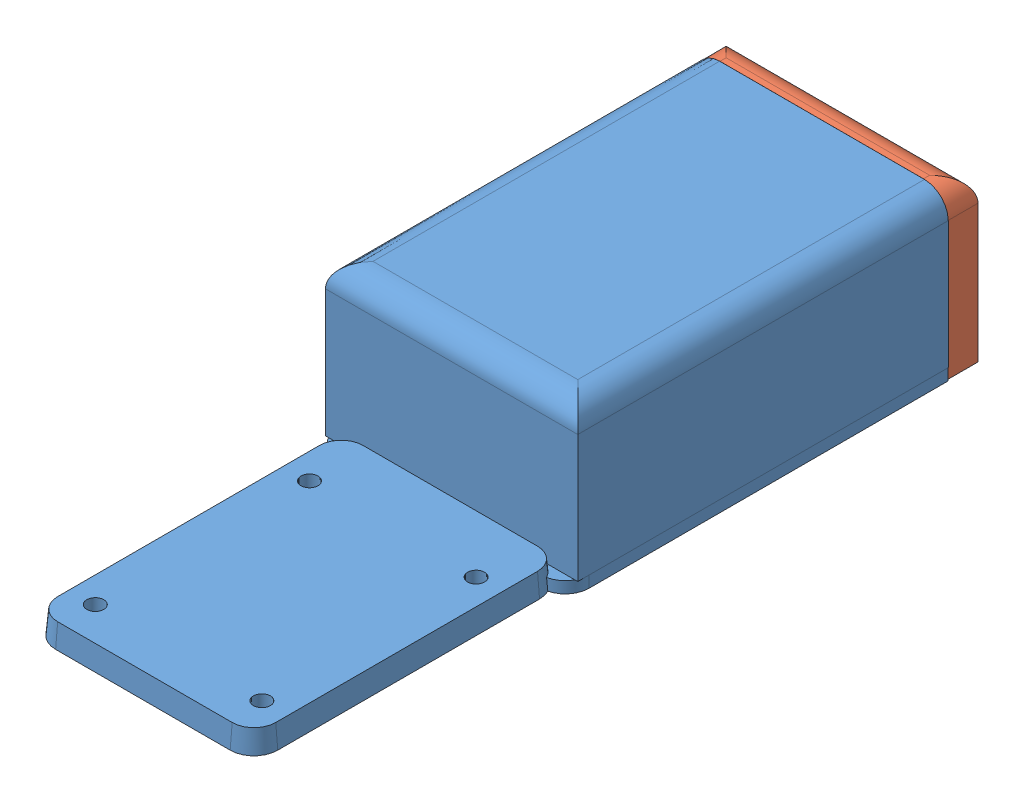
SolidWorks assembly PCB_Holster_Design.SLDASM, configuration Default (file format 9000). Lengths in mm.
Overall size (63.65 41.01 178.79).
2 component instances, 2 part files, 1 mates.
Components (placement in the parent):
- Skateboard Sensor Holster in Progress-1: Skateboard Sensor Holster in Progress.SLDPRT [Default] at (45.3482 66.26 189.4313) size (63.62 41 171.16)
- Cap_Holster-2: Cap_Holster.SLDPRT [Default] at (45.3482 86.8845 52.177) x (-1 0 0) z (0 0 -1) size (63.5 40.77 7.64)
Mates (geometry in assembly coordinates):
- Coincident10: coincident aligned: circle of Skateboard Sensor Holster in Progress-1; circle of Cap_Holster-2
